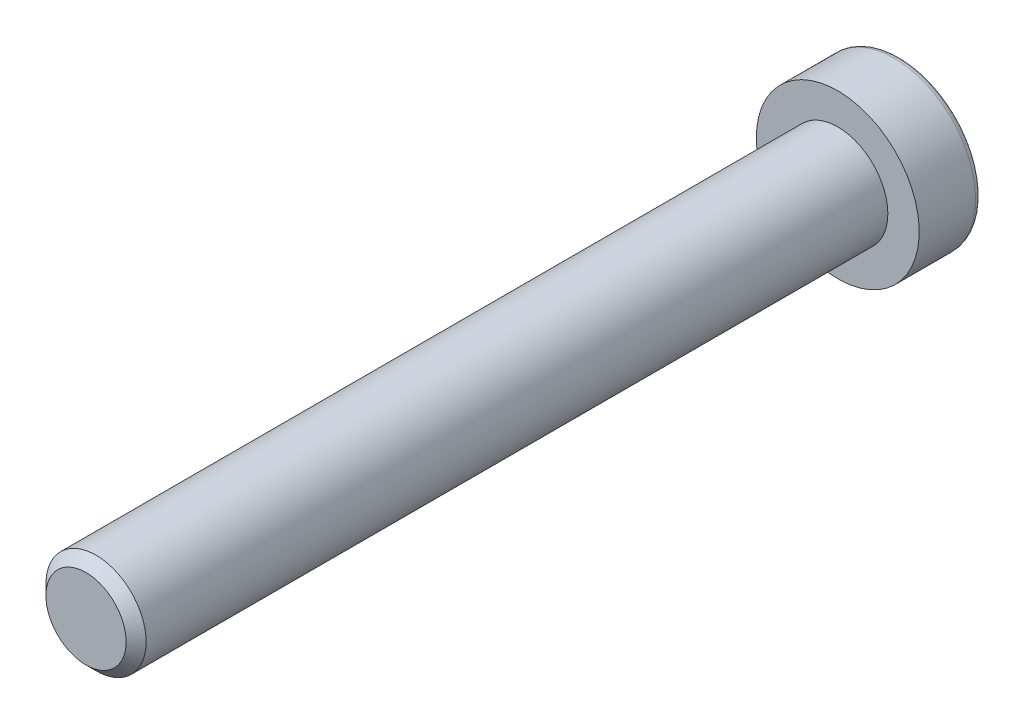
from build123d import *

# Parameters (mm, degrees)
ENLEV_MAT_EXTRU1_DEPTH = 4
ESQUISSE3_W            = 4
ESQUISSE3_H            = 60
CHANFREIN1_SIZE        = 0.8


with BuildPart() as part:
    # Esquisse1 → Base-R_volution (revolve)
    with BuildSketch(Plane(origin=(0, 0, 0), x_dir=(1, 0, 0), z_dir=(0, 1, 0)), mode=Mode.PRIVATE) as base_r_volution_sk:
        with BuildLine():
            Line((0, 0), (6.5, 0))
            Line((6.5, 0), (6.5, 4.5))
            ThreePointArc((6.5, 4.5), (6.353553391, 4.853553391), (6, 5))
            Line((6, 5), (0, 5))
            Line((0, 5), (0, 0))
        make_face()
    revolve(base_r_volution_sk.sketch.rotate(Axis((0, 0, 0), (0, 0, -1)), 180), axis=Axis((0, 0, 0), (0, 0, -1)))

    # Esquisse2 → enlev-mat-Extru1 (cut)
    with BuildSketch(Plane.XY.offset(-5)):
        Polygon((3, -1.732050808), (3, 1.732050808), (0, 3.464101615), (-3, 1.732050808), (-3, -1.732050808), (0, -3.464101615), align=None)
    extrude(amount=ENLEV_MAT_EXTRU1_DEPTH, mode=Mode.SUBTRACT)

    # Esquisse3 → Boss.-R_vol.1 (revolve)
    with BuildSketch(Plane(origin=(0, 0, 0), x_dir=(1, 0, 0), z_dir=(0, 1, 0))):
        with Locations((2, -30)):
            Rectangle(ESQUISSE3_W, ESQUISSE3_H)
    revolve(axis=Axis((0, 0, 0), (0, 0, 1)))

    # Chanfrein1
    chanfrein1_edges = [part.edges().sort_by_distance(p)[0] for p in [
        (-4, 0, 60),
    ]]
    chamfer(chanfrein1_edges, length=CHANFREIN1_SIZE)


solid = part.part
